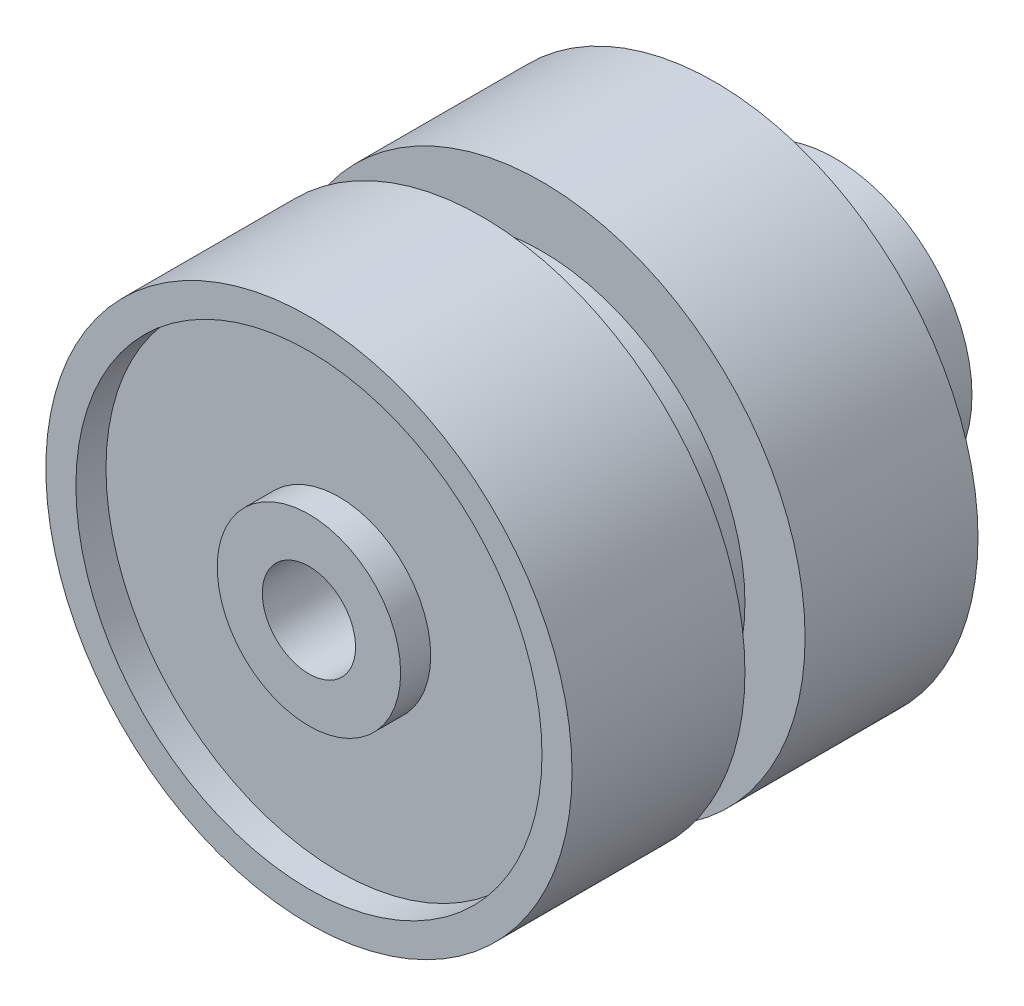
ISO-10303-21;
HEADER;
FILE_DESCRIPTION(('STEP AP214'),'2;1');
FILE_NAME('part.step','',(''),(''),'','','');
FILE_SCHEMA(('AUTOMOTIVE_DESIGN { 1 0 10303 214 1 1 1 1 }'));
ENDSEC;
DATA;
#1=APPLICATION_CONTEXT('core data for automotive mechanical design processes');
#2=APPLICATION_PROTOCOL_DEFINITION('international standard','automotive_design',2000,#1);
#3=PRODUCT_CONTEXT('',#1,'mechanical');
#4=PRODUCT('Part','Part','',(#3));
#5=PRODUCT_RELATED_PRODUCT_CATEGORY('part','',(#4));
#6=PRODUCT_DEFINITION_FORMATION('','',#4);
#7=PRODUCT_DEFINITION_CONTEXT('part definition',#1,'design');
#8=PRODUCT_DEFINITION('design','',#6,#7);
#9=PRODUCT_DEFINITION_SHAPE('','',#8);
#10=(LENGTH_UNIT() NAMED_UNIT(*) SI_UNIT(.MILLI.,.METRE.));
#11=(NAMED_UNIT(*) PLANE_ANGLE_UNIT() SI_UNIT($,.RADIAN.));
#12=(NAMED_UNIT(*) SI_UNIT($,.STERADIAN.) SOLID_ANGLE_UNIT());
#13=UNCERTAINTY_MEASURE_WITH_UNIT(LENGTH_MEASURE(1.E-05),#10,'distance_accuracy_value','');
#14=(GEOMETRIC_REPRESENTATION_CONTEXT(3) GLOBAL_UNCERTAINTY_ASSIGNED_CONTEXT((#13)) GLOBAL_UNIT_ASSIGNED_CONTEXT((#10,
#11,#12)) REPRESENTATION_CONTEXT('',''));
#15=CARTESIAN_POINT('',(0.,0.,0.));
#16=DIRECTION('',(0.,0.,1.));
#17=DIRECTION('',(1.,0.,0.));
#18=AXIS2_PLACEMENT_3D('',#15,#16,#17);
#19=CARTESIAN_POINT('',(0.,1.55,-6.75));
#20=DIRECTION('',(0.,0.,1.));
#21=DIRECTION('',(1.,0.,0.));
#22=AXIS2_PLACEMENT_3D('',#19,#20,#21);
#23=PLANE('',#22);
#24=CARTESIAN_POINT('',(0.,0.,-6.75));
#25=DIRECTION('',(0.,0.,1.));
#26=DIRECTION('',(1.,0.,0.));
#27=AXIS2_PLACEMENT_3D('',#24,#25,#26);
#28=CIRCLE('',#27,8.75);
#29=CARTESIAN_POINT('',(8.75,0.,-6.75));
#30=VERTEX_POINT('',#29);
#31=EDGE_CURVE('E52',#30,#30,#28,.T.);
#32=ORIENTED_EDGE('',*,*,#31,.F.);
#33=EDGE_LOOP('',(#32));
#34=FACE_BOUND('',#33,.T.);
#35=CARTESIAN_POINT('',(0.,0.,-6.75));
#36=DIRECTION('',(0.,0.,1.));
#37=DIRECTION('',(1.,0.,0.));
#38=AXIS2_PLACEMENT_3D('',#35,#36,#37);
#39=CIRCLE('',#38,4.55);
#40=CARTESIAN_POINT('',(4.55,0.,-6.75));
#41=VERTEX_POINT('',#40);
#42=EDGE_CURVE('E10',#41,#41,#39,.F.);
#43=ORIENTED_EDGE('',*,*,#42,.F.);
#44=EDGE_LOOP('',(#43));
#45=FACE_BOUND('',#44,.T.);
#46=ADVANCED_FACE('F37',(#34,#45),#23,.F.);
#47=CARTESIAN_POINT('',(0.,8.75,6.75));
#48=DIRECTION('',(0.,0.,-1.));
#49=DIRECTION('',(-1.,0.,0.));
#50=AXIS2_PLACEMENT_3D('',#47,#48,#49);
#51=PLANE('',#50);
#52=CARTESIAN_POINT('',(0.,0.,6.75));
#53=DIRECTION('',(0.,0.,1.));
#54=DIRECTION('',(1.,0.,0.));
#55=AXIS2_PLACEMENT_3D('',#52,#53,#54);
#56=CIRCLE('',#55,1.55);
#57=CARTESIAN_POINT('',(1.55,0.,6.75));
#58=VERTEX_POINT('',#57);
#59=EDGE_CURVE('E48',#58,#58,#56,.T.);
#60=ORIENTED_EDGE('',*,*,#59,.F.);
#61=EDGE_LOOP('',(#60));
#62=FACE_BOUND('',#61,.T.);
#63=CARTESIAN_POINT('',(0.,0.,6.75));
#64=DIRECTION('',(0.,0.,1.));
#65=DIRECTION('',(1.,0.,0.));
#66=AXIS2_PLACEMENT_3D('',#63,#64,#65);
#67=CIRCLE('',#66,3.05);
#68=CARTESIAN_POINT('',(3.05,0.,6.75));
#69=VERTEX_POINT('',#68);
#70=EDGE_CURVE('E76',#69,#69,#67,.T.);
#71=ORIENTED_EDGE('',*,*,#70,.T.);
#72=EDGE_LOOP('',(#71));
#73=FACE_BOUND('',#72,.T.);
#74=ADVANCED_FACE('F107',(#62,#73),#51,.F.);
#75=CARTESIAN_POINT('',(0.,0.,15.7877691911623));
#76=DIRECTION('',(0.,0.,1.));
#77=DIRECTION('',(1.,0.,0.));
#78=AXIS2_PLACEMENT_3D('',#75,#76,#77);
#79=CYLINDRICAL_SURFACE('',#78,8.75);
#80=CARTESIAN_POINT('',(0.,0.,6.75));
#81=DIRECTION('',(0.,0.,1.));
#82=DIRECTION('',(1.,0.,0.));
#83=AXIS2_PLACEMENT_3D('',#80,#81,#82);
#84=CIRCLE('',#83,8.75);
#85=CARTESIAN_POINT('',(8.75,0.,6.75));
#86=VERTEX_POINT('',#85);
#87=EDGE_CURVE('E44',#86,#86,#84,.T.);
#88=ORIENTED_EDGE('',*,*,#87,.F.);
#89=EDGE_LOOP('',(#88));
#90=FACE_BOUND('',#89,.T.);
#91=CARTESIAN_POINT('',(0.,0.,1.));
#92=DIRECTION('',(0.,0.,1.));
#93=DIRECTION('',(1.,0.,0.));
#94=AXIS2_PLACEMENT_3D('',#91,#92,#93);
#95=CIRCLE('',#94,8.75);
#96=CARTESIAN_POINT('',(8.75,0.,1.));
#97=VERTEX_POINT('',#96);
#98=EDGE_CURVE('E66',#97,#97,#95,.T.);
#99=ORIENTED_EDGE('',*,*,#98,.T.);
#100=EDGE_LOOP('',(#99));
#101=FACE_BOUND('',#100,.T.);
#102=ADVANCED_FACE('F39',(#90,#101),#79,.T.);
#103=CARTESIAN_POINT('',(0.,0.,6.75));
#104=DIRECTION('',(0.,0.,1.));
#105=DIRECTION('',(1.,0.,0.));
#106=AXIS2_PLACEMENT_3D('',#103,#104,#105);
#107=CIRCLE('',#106,7.75);
#108=CARTESIAN_POINT('',(7.75,0.,6.75));
#109=VERTEX_POINT('',#108);
#110=EDGE_CURVE('E70',#109,#109,#107,.T.);
#111=ORIENTED_EDGE('',*,*,#110,.F.);
#112=EDGE_LOOP('',(#111));
#113=FACE_BOUND('',#112,.T.);
#114=ORIENTED_EDGE('',*,*,#87,.T.);
#115=EDGE_LOOP('',(#114));
#116=FACE_BOUND('',#115,.T.);
#117=ADVANCED_FACE('F114',(#113,#116),#51,.F.);
#118=CARTESIAN_POINT('',(0.,0.,15.7877691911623));
#119=DIRECTION('',(0.,0.,1.));
#120=DIRECTION('',(1.,0.,0.));
#121=AXIS2_PLACEMENT_3D('',#118,#119,#120);
#122=CYLINDRICAL_SURFACE('',#121,1.55);
#123=ORIENTED_EDGE('',*,*,#59,.T.);
#124=EDGE_LOOP('',(#123));
#125=FACE_BOUND('',#124,.T.);
#126=CARTESIAN_POINT('',(0.,0.,-10.75));
#127=DIRECTION('',(0.,0.,-1.));
#128=DIRECTION('',(-1.,0.,0.));
#129=AXIS2_PLACEMENT_3D('',#126,#127,#128);
#130=CIRCLE('',#129,1.55);
#131=CARTESIAN_POINT('',(-1.55,0.,-10.75));
#132=VERTEX_POINT('',#131);
#133=EDGE_CURVE('E84',#132,#132,#130,.T.);
#134=ORIENTED_EDGE('',*,*,#133,.T.);
#135=EDGE_LOOP('',(#134));
#136=FACE_BOUND('',#135,.T.);
#137=ADVANCED_FACE('F88',(#125,#136),#122,.F.);
#138=CARTESIAN_POINT('',(0.,0.,15.7877691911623));
#139=DIRECTION('',(0.,0.,1.));
#140=DIRECTION('',(1.,0.,0.));
#141=AXIS2_PLACEMENT_3D('',#138,#139,#140);
#142=CYLINDRICAL_SURFACE('',#141,8.75);
#143=CARTESIAN_POINT('',(0.,0.,-1.));
#144=DIRECTION('',(0.,0.,1.));
#145=DIRECTION('',(1.,0.,0.));
#146=AXIS2_PLACEMENT_3D('',#143,#144,#145);
#147=CIRCLE('',#146,8.75);
#148=CARTESIAN_POINT('',(8.75,0.,-1.));
#149=VERTEX_POINT('',#148);
#150=EDGE_CURVE('E57',#149,#149,#147,.T.);
#151=ORIENTED_EDGE('',*,*,#150,.F.);
#152=EDGE_LOOP('',(#151));
#153=FACE_BOUND('',#152,.T.);
#154=ORIENTED_EDGE('',*,*,#31,.T.);
#155=EDGE_LOOP('',(#154));
#156=FACE_BOUND('',#155,.T.);
#157=ADVANCED_FACE('F119',(#153,#156),#142,.T.);
#158=CARTESIAN_POINT('',(0.,8.75,-1.));
#159=DIRECTION('',(0.,0.,-1.));
#160=DIRECTION('',(-1.,0.,0.));
#161=AXIS2_PLACEMENT_3D('',#158,#159,#160);
#162=PLANE('',#161);
#163=CARTESIAN_POINT('',(0.,0.,-1.));
#164=DIRECTION('',(0.,0.,1.));
#165=DIRECTION('',(1.,0.,0.));
#166=AXIS2_PLACEMENT_3D('',#163,#164,#165);
#167=CIRCLE('',#166,6.75);
#168=CARTESIAN_POINT('',(6.75,0.,-1.));
#169=VERTEX_POINT('',#168);
#170=EDGE_CURVE('E60',#169,#169,#167,.T.);
#171=ORIENTED_EDGE('',*,*,#170,.F.);
#172=EDGE_LOOP('',(#171));
#173=FACE_BOUND('',#172,.T.);
#174=ORIENTED_EDGE('',*,*,#150,.T.);
#175=EDGE_LOOP('',(#174));
#176=FACE_BOUND('',#175,.T.);
#177=ADVANCED_FACE('F147',(#173,#176),#162,.F.);
#178=CARTESIAN_POINT('',(0.,0.,15.7877691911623));
#179=DIRECTION('',(0.,0.,1.));
#180=DIRECTION('',(1.,0.,0.));
#181=AXIS2_PLACEMENT_3D('',#178,#179,#180);
#182=CYLINDRICAL_SURFACE('',#181,6.75);
#183=CARTESIAN_POINT('',(0.,0.,1.));
#184=DIRECTION('',(0.,0.,1.));
#185=DIRECTION('',(1.,0.,0.));
#186=AXIS2_PLACEMENT_3D('',#183,#184,#185);
#187=CIRCLE('',#186,6.75);
#188=CARTESIAN_POINT('',(6.75,0.,1.));
#189=VERTEX_POINT('',#188);
#190=EDGE_CURVE('E63',#189,#189,#187,.T.);
#191=ORIENTED_EDGE('',*,*,#190,.F.);
#192=EDGE_LOOP('',(#191));
#193=FACE_BOUND('',#192,.T.);
#194=ORIENTED_EDGE('',*,*,#170,.T.);
#195=EDGE_LOOP('',(#194));
#196=FACE_BOUND('',#195,.T.);
#197=ADVANCED_FACE('F141',(#193,#196),#182,.T.);
#198=CARTESIAN_POINT('',(0.,6.75,1.));
#199=DIRECTION('',(0.,0.,1.));
#200=DIRECTION('',(1.,0.,0.));
#201=AXIS2_PLACEMENT_3D('',#198,#199,#200);
#202=PLANE('',#201);
#203=ORIENTED_EDGE('',*,*,#98,.F.);
#204=EDGE_LOOP('',(#203));
#205=FACE_BOUND('',#204,.T.);
#206=ORIENTED_EDGE('',*,*,#190,.T.);
#207=EDGE_LOOP('',(#206));
#208=FACE_BOUND('',#207,.T.);
#209=ADVANCED_FACE('F132',(#205,#208),#202,.F.);
#210=CARTESIAN_POINT('',(0.,0.,5.75));
#211=DIRECTION('',(0.,0.,1.));
#212=DIRECTION('',(1.,0.,0.));
#213=AXIS2_PLACEMENT_3D('',#210,#211,#212);
#214=CYLINDRICAL_SURFACE('',#213,7.75);
#215=CARTESIAN_POINT('',(0.,0.,5.75));
#216=DIRECTION('',(0.,0.,1.));
#217=DIRECTION('',(1.,0.,0.));
#218=AXIS2_PLACEMENT_3D('',#215,#216,#217);
#219=CIRCLE('',#218,7.75);
#220=CARTESIAN_POINT('',(7.75,0.,5.75));
#221=VERTEX_POINT('',#220);
#222=EDGE_CURVE('E69',#221,#221,#219,.T.);
#223=ORIENTED_EDGE('',*,*,#222,.F.);
#224=EDGE_LOOP('',(#223));
#225=FACE_BOUND('',#224,.T.);
#226=ORIENTED_EDGE('',*,*,#110,.T.);
#227=EDGE_LOOP('',(#226));
#228=FACE_BOUND('',#227,.T.);
#229=ADVANCED_FACE('F131',(#225,#228),#214,.F.);
#230=CARTESIAN_POINT('',(0.,0.,5.75));
#231=DIRECTION('',(0.,0.,1.));
#232=DIRECTION('',(1.,0.,0.));
#233=AXIS2_PLACEMENT_3D('',#230,#231,#232);
#234=PLANE('',#233);
#235=CARTESIAN_POINT('',(0.,0.,5.75));
#236=DIRECTION('',(0.,0.,1.));
#237=DIRECTION('',(1.,0.,0.));
#238=AXIS2_PLACEMENT_3D('',#235,#236,#237);
#239=CIRCLE('',#238,3.05);
#240=CARTESIAN_POINT('',(3.05,0.,5.75));
#241=VERTEX_POINT('',#240);
#242=EDGE_CURVE('E73',#241,#241,#239,.T.);
#243=ORIENTED_EDGE('',*,*,#242,.F.);
#244=EDGE_LOOP('',(#243));
#245=FACE_BOUND('',#244,.T.);
#246=ORIENTED_EDGE('',*,*,#222,.T.);
#247=EDGE_LOOP('',(#246));
#248=FACE_BOUND('',#247,.T.);
#249=ADVANCED_FACE('F103',(#245,#248),#234,.T.);
#250=CARTESIAN_POINT('',(0.,0.,5.75));
#251=DIRECTION('',(0.,0.,1.));
#252=DIRECTION('',(1.,0.,0.));
#253=AXIS2_PLACEMENT_3D('',#250,#251,#252);
#254=CYLINDRICAL_SURFACE('',#253,3.05);
#255=ORIENTED_EDGE('',*,*,#242,.T.);
#256=EDGE_LOOP('',(#255));
#257=FACE_BOUND('',#256,.T.);
#258=ORIENTED_EDGE('',*,*,#70,.F.);
#259=EDGE_LOOP('',(#258));
#260=FACE_BOUND('',#259,.T.);
#261=ADVANCED_FACE('F93',(#257,#260),#254,.T.);
#262=CARTESIAN_POINT('',(0.,0.,-10.75));
#263=DIRECTION('',(0.,0.,-1.));
#264=DIRECTION('',(-1.,0.,0.));
#265=AXIS2_PLACEMENT_3D('',#262,#263,#264);
#266=PLANE('',#265);
#267=CARTESIAN_POINT('',(0.,0.,-10.75));
#268=DIRECTION('',(0.,0.,-1.));
#269=DIRECTION('',(-1.,0.,0.));
#270=AXIS2_PLACEMENT_3D('',#267,#268,#269);
#271=CIRCLE('',#270,4.55);
#272=CARTESIAN_POINT('',(-4.55,0.,-10.75));
#273=VERTEX_POINT('',#272);
#274=EDGE_CURVE('E79',#273,#273,#271,.T.);
#275=ORIENTED_EDGE('',*,*,#274,.T.);
#276=EDGE_LOOP('',(#275));
#277=FACE_BOUND('',#276,.T.);
#278=ORIENTED_EDGE('',*,*,#133,.F.);
#279=EDGE_LOOP('',(#278));
#280=FACE_BOUND('',#279,.T.);
#281=ADVANCED_FACE('F90',(#277,#280),#266,.T.);
#282=CARTESIAN_POINT('',(0.,0.,-10.75));
#283=DIRECTION('',(0.,0.,1.));
#284=DIRECTION('',(1.,0.,0.));
#285=AXIS2_PLACEMENT_3D('',#282,#283,#284);
#286=CYLINDRICAL_SURFACE('',#285,4.55);
#287=ORIENTED_EDGE('',*,*,#274,.F.);
#288=EDGE_LOOP('',(#287));
#289=FACE_BOUND('',#288,.T.);
#290=ORIENTED_EDGE('',*,*,#42,.T.);
#291=EDGE_LOOP('',(#290));
#292=FACE_BOUND('',#291,.T.);
#293=ADVANCED_FACE('F92',(#289,#292),#286,.T.);
#294=CLOSED_SHELL('',(#46,#74,#102,#117,#137,#157,#177,#197,#209,#229,#249,#261,#281,#293));
#295=MANIFOLD_SOLID_BREP('B2',#294);
#296=ADVANCED_BREP_SHAPE_REPRESENTATION('',(#18,#295),#14);
#297=SHAPE_DEFINITION_REPRESENTATION(#9,#296);
ENDSEC;
END-ISO-10303-21;
